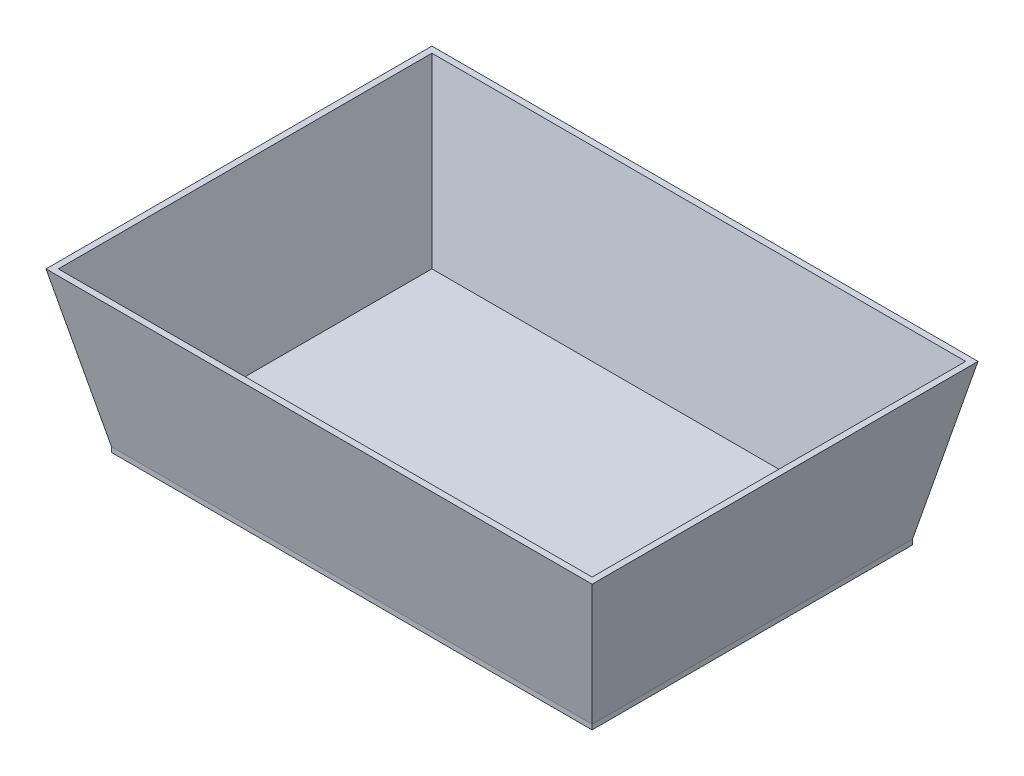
ISO-10303-21;
HEADER;
FILE_DESCRIPTION(('STEP AP214'),'2;1');
FILE_NAME('part.step','',(''),(''),'','','');
FILE_SCHEMA(('AUTOMOTIVE_DESIGN { 1 0 10303 214 1 1 1 1 }'));
ENDSEC;
DATA;
#1=APPLICATION_CONTEXT('core data for automotive mechanical design processes');
#2=APPLICATION_PROTOCOL_DEFINITION('international standard','automotive_design',2000,#1);
#3=PRODUCT_CONTEXT('',#1,'mechanical');
#4=PRODUCT('Part','Part','',(#3));
#5=PRODUCT_RELATED_PRODUCT_CATEGORY('part','',(#4));
#6=PRODUCT_DEFINITION_FORMATION('','',#4);
#7=PRODUCT_DEFINITION_CONTEXT('part definition',#1,'design');
#8=PRODUCT_DEFINITION('design','',#6,#7);
#9=PRODUCT_DEFINITION_SHAPE('','',#8);
#10=(LENGTH_UNIT() NAMED_UNIT(*) SI_UNIT(.MILLI.,.METRE.));
#11=(NAMED_UNIT(*) PLANE_ANGLE_UNIT() SI_UNIT($,.RADIAN.));
#12=(NAMED_UNIT(*) SI_UNIT($,.STERADIAN.) SOLID_ANGLE_UNIT());
#13=UNCERTAINTY_MEASURE_WITH_UNIT(LENGTH_MEASURE(1.E-05),#10,'distance_accuracy_value','');
#14=(GEOMETRIC_REPRESENTATION_CONTEXT(3) GLOBAL_UNCERTAINTY_ASSIGNED_CONTEXT((#13)) GLOBAL_UNIT_ASSIGNED_CONTEXT((#10,
#11,#12)) REPRESENTATION_CONTEXT('',''));
#15=CARTESIAN_POINT('',(0.,0.,0.));
#16=DIRECTION('',(0.,0.,1.));
#17=DIRECTION('',(1.,0.,0.));
#18=AXIS2_PLACEMENT_3D('',#15,#16,#17);
#19=CARTESIAN_POINT('',(123.825,0.,82.55));
#20=DIRECTION('',(0.978147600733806,-0.207911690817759,0.));
#21=DIRECTION('',(0.207911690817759,0.978147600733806,0.));
#22=AXIS2_PLACEMENT_3D('',#19,#20,#21);
#23=PLANE('',#22);
#24=DIRECTION('',(0.,0.,-1.));
#25=VECTOR('',#24,1.);
#26=CARTESIAN_POINT('',(123.825,0.,82.55));
#27=LINE('',#26,#25);
#28=CARTESIAN_POINT('',(123.825,0.,82.55));
#29=VERTEX_POINT('',#28);
#30=CARTESIAN_POINT('',(123.825,0.,-82.55));
#31=VERTEX_POINT('',#30);
#32=EDGE_CURVE('E178',#29,#31,#27,.T.);
#33=ORIENTED_EDGE('',*,*,#32,.T.);
#34=DIRECTION('',(-0.203558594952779,-0.957667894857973,0.203558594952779));
#35=VECTOR('',#34,1.);
#36=CARTESIAN_POINT('',(113.563349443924,-48.2772701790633,-72.2883494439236));
#37=LINE('',#36,#35);
#38=CARTESIAN_POINT('',(140.696677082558,79.375,-99.421677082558));
#39=VERTEX_POINT('',#38);
#40=EDGE_CURVE('E200',#39,#31,#37,.T.);
#41=ORIENTED_EDGE('',*,*,#40,.F.);
#42=DIRECTION('',(0.,0.,1.));
#43=VECTOR('',#42,1.);
#44=CARTESIAN_POINT('',(140.696677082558,79.375,0.));
#45=LINE('',#44,#43);
#46=CARTESIAN_POINT('',(140.696677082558,79.375,99.421677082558));
#47=VERTEX_POINT('',#46);
#48=EDGE_CURVE('E199',#47,#39,#45,.F.);
#49=ORIENTED_EDGE('',*,*,#48,.F.);
#50=DIRECTION('',(-0.203558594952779,-0.957667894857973,-0.203558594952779));
#51=VECTOR('',#50,1.);
#52=CARTESIAN_POINT('',(123.825,0.,82.55));
#53=LINE('',#52,#51);
#54=EDGE_CURVE('E206',#47,#29,#53,.T.);
#55=ORIENTED_EDGE('',*,*,#54,.T.);
#56=EDGE_LOOP('',(#33,#41,#49,#55));
#57=FACE_BOUND('',#56,.T.);
#58=ADVANCED_FACE('F47',(#57),#23,.T.);
#59=CARTESIAN_POINT('',(-123.825,0.,-82.55));
#60=DIRECTION('',(0.,-0.207911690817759,-0.978147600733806));
#61=DIRECTION('',(0.,0.978147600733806,-0.207911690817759));
#62=AXIS2_PLACEMENT_3D('',#59,#60,#61);
#63=PLANE('',#62);
#64=DIRECTION('',(-1.,0.,0.));
#65=VECTOR('',#64,1.);
#66=CARTESIAN_POINT('',(-123.825,0.,-82.55));
#67=LINE('',#66,#65);
#68=CARTESIAN_POINT('',(-123.825,0.,-82.55));
#69=VERTEX_POINT('',#68);
#70=EDGE_CURVE('E190',#31,#69,#67,.T.);
#71=ORIENTED_EDGE('',*,*,#70,.T.);
#72=DIRECTION('',(0.203558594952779,-0.957667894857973,0.203558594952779));
#73=VECTOR('',#72,1.);
#74=CARTESIAN_POINT('',(-116.983899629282,-32.1848467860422,-75.7088996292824));
#75=LINE('',#74,#73);
#76=CARTESIAN_POINT('',(-140.696677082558,79.375,-99.421677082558));
#77=VERTEX_POINT('',#76);
#78=EDGE_CURVE('E205',#77,#69,#75,.T.);
#79=ORIENTED_EDGE('',*,*,#78,.F.);
#80=DIRECTION('',(1.,0.,0.));
#81=VECTOR('',#80,1.);
#82=CARTESIAN_POINT('',(0.,79.375,-99.421677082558));
#83=LINE('',#82,#81);
#84=EDGE_CURVE('E219',#39,#77,#83,.F.);
#85=ORIENTED_EDGE('',*,*,#84,.F.);
#86=ORIENTED_EDGE('',*,*,#40,.T.);
#87=EDGE_LOOP('',(#71,#79,#85,#86));
#88=FACE_BOUND('',#87,.T.);
#89=ADVANCED_FACE('F49',(#88),#63,.T.);
#90=CARTESIAN_POINT('',(-123.825,0.,82.55));
#91=DIRECTION('',(-0.978147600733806,-0.207911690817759,0.));
#92=DIRECTION('',(0.207911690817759,-0.978147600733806,0.));
#93=AXIS2_PLACEMENT_3D('',#90,#91,#92);
#94=PLANE('',#93);
#95=DIRECTION('',(0.,0.,1.));
#96=VECTOR('',#95,1.);
#97=CARTESIAN_POINT('',(-123.825,0.,82.55));
#98=LINE('',#97,#96);
#99=CARTESIAN_POINT('',(-123.825,0.,82.55));
#100=VERTEX_POINT('',#99);
#101=EDGE_CURVE('E152',#69,#100,#98,.T.);
#102=ORIENTED_EDGE('',*,*,#101,.T.);
#103=DIRECTION('',(0.203558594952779,-0.957667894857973,-0.203558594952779));
#104=VECTOR('',#103,1.);
#105=CARTESIAN_POINT('',(-123.825,0.,82.55));
#106=LINE('',#105,#104);
#107=CARTESIAN_POINT('',(-140.696677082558,79.375,99.421677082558));
#108=VERTEX_POINT('',#107);
#109=EDGE_CURVE('E210',#108,#100,#106,.T.);
#110=ORIENTED_EDGE('',*,*,#109,.F.);
#111=DIRECTION('',(0.,0.,-1.));
#112=VECTOR('',#111,1.);
#113=CARTESIAN_POINT('',(-140.696677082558,79.375,0.));
#114=LINE('',#113,#112);
#115=EDGE_CURVE('E222',#77,#108,#114,.F.);
#116=ORIENTED_EDGE('',*,*,#115,.F.);
#117=ORIENTED_EDGE('',*,*,#78,.T.);
#118=EDGE_LOOP('',(#102,#110,#116,#117));
#119=FACE_BOUND('',#118,.T.);
#120=ADVANCED_FACE('F269',(#119),#94,.T.);
#121=CARTESIAN_POINT('',(-123.825,0.,82.55));
#122=DIRECTION('',(0.,-0.207911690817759,0.978147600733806));
#123=DIRECTION('',(0.,-0.978147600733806,-0.207911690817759));
#124=AXIS2_PLACEMENT_3D('',#121,#122,#123);
#125=PLANE('',#124);
#126=DIRECTION('',(1.,0.,0.));
#127=VECTOR('',#126,1.);
#128=CARTESIAN_POINT('',(-123.825,0.,82.55));
#129=LINE('',#128,#127);
#130=EDGE_CURVE('E195',#100,#29,#129,.T.);
#131=ORIENTED_EDGE('',*,*,#130,.T.);
#132=ORIENTED_EDGE('',*,*,#54,.F.);
#133=DIRECTION('',(-1.,0.,0.));
#134=VECTOR('',#133,1.);
#135=CARTESIAN_POINT('',(0.,79.375,99.421677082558));
#136=LINE('',#135,#134);
#137=EDGE_CURVE('E71',#108,#47,#136,.F.);
#138=ORIENTED_EDGE('',*,*,#137,.F.);
#139=ORIENTED_EDGE('',*,*,#109,.T.);
#140=EDGE_LOOP('',(#131,#132,#138,#139));
#141=FACE_BOUND('',#140,.T.);
#142=ADVANCED_FACE('F274',(#141),#125,.T.);
#143=CARTESIAN_POINT('',(0.,79.375,0.));
#144=DIRECTION('',(0.,-1.,0.));
#145=DIRECTION('',(0.,0.,-1.));
#146=AXIS2_PLACEMENT_3D('',#143,#144,#145);
#147=PLANE('',#146);
#148=DIRECTION('',(-1.,0.,0.));
#149=VECTOR('',#148,1.);
#150=CARTESIAN_POINT('',(-137.521677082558,79.375,-96.246677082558));
#151=LINE('',#150,#149);
#152=CARTESIAN_POINT('',(137.521677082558,79.375,-96.246677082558));
#153=VERTEX_POINT('',#152);
#154=CARTESIAN_POINT('',(-137.521677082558,79.375,-96.246677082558));
#155=VERTEX_POINT('',#154);
#156=EDGE_CURVE('E157',#153,#155,#151,.T.);
#157=ORIENTED_EDGE('',*,*,#156,.F.);
#158=DIRECTION('',(0.,0.,-1.));
#159=VECTOR('',#158,1.);
#160=CARTESIAN_POINT('',(137.521677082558,79.375,96.246677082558));
#161=LINE('',#160,#159);
#162=CARTESIAN_POINT('',(137.521677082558,79.375,96.246677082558));
#163=VERTEX_POINT('',#162);
#164=EDGE_CURVE('E63',#163,#153,#161,.T.);
#165=ORIENTED_EDGE('',*,*,#164,.F.);
#166=DIRECTION('',(1.,0.,0.));
#167=VECTOR('',#166,1.);
#168=CARTESIAN_POINT('',(-137.521677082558,79.375,96.246677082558));
#169=LINE('',#168,#167);
#170=CARTESIAN_POINT('',(-137.521677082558,79.375,96.246677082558));
#171=VERTEX_POINT('',#170);
#172=EDGE_CURVE('E170',#171,#163,#169,.T.);
#173=ORIENTED_EDGE('',*,*,#172,.F.);
#174=DIRECTION('',(0.,0.,1.));
#175=VECTOR('',#174,1.);
#176=CARTESIAN_POINT('',(-137.521677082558,79.375,96.246677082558));
#177=LINE('',#176,#175);
#178=EDGE_CURVE('E166',#155,#171,#177,.T.);
#179=ORIENTED_EDGE('',*,*,#178,.F.);
#180=EDGE_LOOP('',(#157,#165,#173,#179));
#181=FACE_BOUND('',#180,.T.);
#182=ORIENTED_EDGE('',*,*,#48,.T.);
#183=ORIENTED_EDGE('',*,*,#84,.T.);
#184=ORIENTED_EDGE('',*,*,#115,.T.);
#185=ORIENTED_EDGE('',*,*,#137,.T.);
#186=EDGE_LOOP('',(#182,#183,#184,#185));
#187=FACE_BOUND('',#186,.T.);
#188=ADVANCED_FACE('F247',(#181,#187),#147,.F.);
#189=CARTESIAN_POINT('',(137.521677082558,79.375,96.246677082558));
#190=DIRECTION('',(0.978147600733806,-0.207911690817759,0.));
#191=DIRECTION('',(0.207911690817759,0.978147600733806,0.));
#192=AXIS2_PLACEMENT_3D('',#189,#190,#191);
#193=PLANE('',#192);
#194=DIRECTION('',(0.,0.,1.));
#195=VECTOR('',#194,1.);
#196=CARTESIAN_POINT('',(120.65,0.,0.));
#197=LINE('',#196,#195);
#198=CARTESIAN_POINT('',(120.65,0.,-79.375));
#199=VERTEX_POINT('',#198);
#200=CARTESIAN_POINT('',(120.65,0.,79.375));
#201=VERTEX_POINT('',#200);
#202=EDGE_CURVE('E11',#199,#201,#197,.T.);
#203=ORIENTED_EDGE('',*,*,#202,.T.);
#204=DIRECTION('',(0.203558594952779,0.957667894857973,0.203558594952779));
#205=VECTOR('',#204,1.);
#206=CARTESIAN_POINT('',(126.124952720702,25.7576274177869,84.8499527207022));
#207=LINE('',#206,#205);
#208=EDGE_CURVE('E175',#201,#163,#207,.T.);
#209=ORIENTED_EDGE('',*,*,#208,.T.);
#210=ORIENTED_EDGE('',*,*,#164,.T.);
#211=DIRECTION('',(0.203558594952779,0.957667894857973,-0.203558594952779));
#212=VECTOR('',#211,1.);
#213=CARTESIAN_POINT('',(129.545502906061,41.850050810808,-88.270502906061));
#214=LINE('',#213,#212);
#215=EDGE_CURVE('E174',#199,#153,#214,.T.);
#216=ORIENTED_EDGE('',*,*,#215,.F.);
#217=EDGE_LOOP('',(#203,#209,#210,#216));
#218=FACE_BOUND('',#217,.T.);
#219=ADVANCED_FACE('F250',(#218),#193,.F.);
#220=CARTESIAN_POINT('',(-137.521677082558,79.375,96.246677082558));
#221=DIRECTION('',(0.,-0.207911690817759,0.978147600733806));
#222=DIRECTION('',(0.,-0.978147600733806,-0.207911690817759));
#223=AXIS2_PLACEMENT_3D('',#220,#221,#222);
#224=PLANE('',#223);
#225=DIRECTION('',(-1.,0.,0.));
#226=VECTOR('',#225,1.);
#227=CARTESIAN_POINT('',(0.,0.,79.375));
#228=LINE('',#227,#226);
#229=CARTESIAN_POINT('',(-120.65,0.,79.3749999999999));
#230=VERTEX_POINT('',#229);
#231=EDGE_CURVE('E56',#201,#230,#228,.T.);
#232=ORIENTED_EDGE('',*,*,#231,.T.);
#233=DIRECTION('',(-0.203558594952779,0.957667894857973,0.203558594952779));
#234=VECTOR('',#233,1.);
#235=CARTESIAN_POINT('',(-137.521677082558,79.375,96.246677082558));
#236=LINE('',#235,#234);
#237=EDGE_CURVE('E179',#230,#171,#236,.T.);
#238=ORIENTED_EDGE('',*,*,#237,.T.);
#239=ORIENTED_EDGE('',*,*,#172,.T.);
#240=ORIENTED_EDGE('',*,*,#208,.F.);
#241=EDGE_LOOP('',(#232,#238,#239,#240));
#242=FACE_BOUND('',#241,.T.);
#243=ADVANCED_FACE('F238',(#242),#224,.F.);
#244=CARTESIAN_POINT('',(-137.521677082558,79.375,96.246677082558));
#245=DIRECTION('',(-0.978147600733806,-0.207911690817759,0.));
#246=DIRECTION('',(0.207911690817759,-0.978147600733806,0.));
#247=AXIS2_PLACEMENT_3D('',#244,#245,#246);
#248=PLANE('',#247);
#249=DIRECTION('',(0.,0.,-1.));
#250=VECTOR('',#249,1.);
#251=CARTESIAN_POINT('',(-120.65,0.,0.));
#252=LINE('',#251,#250);
#253=CARTESIAN_POINT('',(-120.65,0.,-79.375));
#254=VERTEX_POINT('',#253);
#255=EDGE_CURVE('E230',#230,#254,#252,.T.);
#256=ORIENTED_EDGE('',*,*,#255,.T.);
#257=DIRECTION('',(-0.203558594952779,0.957667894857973,-0.203558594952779));
#258=VECTOR('',#257,1.);
#259=CARTESIAN_POINT('',(-137.521677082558,79.375,-96.246677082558));
#260=LINE('',#259,#258);
#261=EDGE_CURVE('E182',#254,#155,#260,.T.);
#262=ORIENTED_EDGE('',*,*,#261,.T.);
#263=ORIENTED_EDGE('',*,*,#178,.T.);
#264=ORIENTED_EDGE('',*,*,#237,.F.);
#265=EDGE_LOOP('',(#256,#262,#263,#264));
#266=FACE_BOUND('',#265,.T.);
#267=ADVANCED_FACE('F241',(#266),#248,.F.);
#268=CARTESIAN_POINT('',(-137.521677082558,79.375,-96.246677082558));
#269=DIRECTION('',(0.,-0.207911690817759,-0.978147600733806));
#270=DIRECTION('',(0.,0.978147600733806,-0.207911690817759));
#271=AXIS2_PLACEMENT_3D('',#268,#269,#270);
#272=PLANE('',#271);
#273=DIRECTION('',(1.,0.,0.));
#274=VECTOR('',#273,1.);
#275=CARTESIAN_POINT('',(0.,0.,-79.375));
#276=LINE('',#275,#274);
#277=EDGE_CURVE('E204',#254,#199,#276,.T.);
#278=ORIENTED_EDGE('',*,*,#277,.T.);
#279=ORIENTED_EDGE('',*,*,#215,.T.);
#280=ORIENTED_EDGE('',*,*,#156,.T.);
#281=ORIENTED_EDGE('',*,*,#261,.F.);
#282=EDGE_LOOP('',(#278,#279,#280,#281));
#283=FACE_BOUND('',#282,.T.);
#284=ADVANCED_FACE('F249',(#283),#272,.F.);
#285=CARTESIAN_POINT('',(0.,0.,0.));
#286=DIRECTION('',(0.,-1.,0.));
#287=DIRECTION('',(0.,0.,-1.));
#288=AXIS2_PLACEMENT_3D('',#285,#286,#287);
#289=PLANE('',#288);
#290=ORIENTED_EDGE('',*,*,#202,.F.);
#291=ORIENTED_EDGE('',*,*,#277,.F.);
#292=ORIENTED_EDGE('',*,*,#255,.F.);
#293=ORIENTED_EDGE('',*,*,#231,.F.);
#294=EDGE_LOOP('',(#290,#291,#292,#293));
#295=FACE_BOUND('',#294,.T.);
#296=ADVANCED_FACE('F251',(#295),#289,.F.);
#297=CARTESIAN_POINT('',(-123.825,-2.54,-82.55));
#298=DIRECTION('',(1.,0.,0.));
#299=DIRECTION('',(0.,0.,-1.));
#300=AXIS2_PLACEMENT_3D('',#297,#298,#299);
#301=PLANE('',#300);
#302=ORIENTED_EDGE('',*,*,#101,.F.);
#303=DIRECTION('',(0.,1.,0.));
#304=VECTOR('',#303,1.);
#305=CARTESIAN_POINT('',(-123.825,-2.54,-82.55));
#306=LINE('',#305,#304);
#307=CARTESIAN_POINT('',(-123.825,-2.54,-82.55));
#308=VERTEX_POINT('',#307);
#309=EDGE_CURVE('E131',#308,#69,#306,.T.);
#310=ORIENTED_EDGE('',*,*,#309,.F.);
#311=DIRECTION('',(0.,0.,-1.));
#312=VECTOR('',#311,1.);
#313=CARTESIAN_POINT('',(-123.825,-2.54,-82.55));
#314=LINE('',#313,#312);
#315=CARTESIAN_POINT('',(-123.825,-2.54,82.55));
#316=VERTEX_POINT('',#315);
#317=EDGE_CURVE('E139',#316,#308,#314,.T.);
#318=ORIENTED_EDGE('',*,*,#317,.F.);
#319=DIRECTION('',(0.,1.,0.));
#320=VECTOR('',#319,1.);
#321=CARTESIAN_POINT('',(-123.825,-2.54,82.55));
#322=LINE('',#321,#320);
#323=EDGE_CURVE('E293',#316,#100,#322,.T.);
#324=ORIENTED_EDGE('',*,*,#323,.T.);
#325=EDGE_LOOP('',(#302,#310,#318,#324));
#326=FACE_BOUND('',#325,.T.);
#327=ADVANCED_FACE('F150',(#326),#301,.F.);
#328=CARTESIAN_POINT('',(123.825,-2.54,-82.55));
#329=DIRECTION('',(0.,0.,1.));
#330=DIRECTION('',(1.,0.,0.));
#331=AXIS2_PLACEMENT_3D('',#328,#329,#330);
#332=PLANE('',#331);
#333=ORIENTED_EDGE('',*,*,#70,.F.);
#334=DIRECTION('',(0.,1.,0.));
#335=VECTOR('',#334,1.);
#336=CARTESIAN_POINT('',(123.825,-2.54,-82.55));
#337=LINE('',#336,#335);
#338=CARTESIAN_POINT('',(123.825,-2.54,-82.55));
#339=VERTEX_POINT('',#338);
#340=EDGE_CURVE('E134',#339,#31,#337,.T.);
#341=ORIENTED_EDGE('',*,*,#340,.F.);
#342=DIRECTION('',(1.,0.,0.));
#343=VECTOR('',#342,1.);
#344=CARTESIAN_POINT('',(123.825,-2.54,-82.55));
#345=LINE('',#344,#343);
#346=EDGE_CURVE('E127',#308,#339,#345,.T.);
#347=ORIENTED_EDGE('',*,*,#346,.F.);
#348=ORIENTED_EDGE('',*,*,#309,.T.);
#349=EDGE_LOOP('',(#333,#341,#347,#348));
#350=FACE_BOUND('',#349,.T.);
#351=ADVANCED_FACE('F129',(#350),#332,.F.);
#352=CARTESIAN_POINT('',(123.825,-2.54,-82.55));
#353=DIRECTION('',(-1.,0.,0.));
#354=DIRECTION('',(0.,0.,1.));
#355=AXIS2_PLACEMENT_3D('',#352,#353,#354);
#356=PLANE('',#355);
#357=ORIENTED_EDGE('',*,*,#32,.F.);
#358=DIRECTION('',(0.,1.,0.));
#359=VECTOR('',#358,1.);
#360=CARTESIAN_POINT('',(123.825,-2.54,82.55));
#361=LINE('',#360,#359);
#362=CARTESIAN_POINT('',(123.825,-2.54,82.55));
#363=VERTEX_POINT('',#362);
#364=EDGE_CURVE('E159',#363,#29,#361,.T.);
#365=ORIENTED_EDGE('',*,*,#364,.F.);
#366=DIRECTION('',(0.,0.,1.));
#367=VECTOR('',#366,1.);
#368=CARTESIAN_POINT('',(123.825,-2.54,-82.55));
#369=LINE('',#368,#367);
#370=EDGE_CURVE('E138',#339,#363,#369,.T.);
#371=ORIENTED_EDGE('',*,*,#370,.F.);
#372=ORIENTED_EDGE('',*,*,#340,.T.);
#373=EDGE_LOOP('',(#357,#365,#371,#372));
#374=FACE_BOUND('',#373,.T.);
#375=ADVANCED_FACE('F287',(#374),#356,.F.);
#376=CARTESIAN_POINT('',(123.825,-2.54,82.55));
#377=DIRECTION('',(0.,0.,-1.));
#378=DIRECTION('',(-1.,0.,0.));
#379=AXIS2_PLACEMENT_3D('',#376,#377,#378);
#380=PLANE('',#379);
#381=ORIENTED_EDGE('',*,*,#130,.F.);
#382=ORIENTED_EDGE('',*,*,#323,.F.);
#383=DIRECTION('',(-1.,0.,0.));
#384=VECTOR('',#383,1.);
#385=CARTESIAN_POINT('',(123.825,-2.54,82.55));
#386=LINE('',#385,#384);
#387=EDGE_CURVE('E144',#363,#316,#386,.T.);
#388=ORIENTED_EDGE('',*,*,#387,.F.);
#389=ORIENTED_EDGE('',*,*,#364,.T.);
#390=EDGE_LOOP('',(#381,#382,#388,#389));
#391=FACE_BOUND('',#390,.T.);
#392=ADVANCED_FACE('F299',(#391),#380,.F.);
#393=CARTESIAN_POINT('',(0.,-2.54,0.));
#394=DIRECTION('',(0.,-1.,0.));
#395=DIRECTION('',(0.,0.,-1.));
#396=AXIS2_PLACEMENT_3D('',#393,#394,#395);
#397=PLANE('',#396);
#398=ORIENTED_EDGE('',*,*,#317,.T.);
#399=ORIENTED_EDGE('',*,*,#346,.T.);
#400=ORIENTED_EDGE('',*,*,#370,.T.);
#401=ORIENTED_EDGE('',*,*,#387,.T.);
#402=EDGE_LOOP('',(#398,#399,#400,#401));
#403=FACE_BOUND('',#402,.T.);
#404=ADVANCED_FACE('F142',(#403),#397,.T.);
#405=CLOSED_SHELL('',(#58,#89,#120,#142,#188,#219,#243,#267,#284,#296,#327,#351,#375,#392,#404));
#406=MANIFOLD_SOLID_BREP('B2',#405);
#407=ADVANCED_BREP_SHAPE_REPRESENTATION('',(#18,#406),#14);
#408=SHAPE_DEFINITION_REPRESENTATION(#9,#407);
ENDSEC;
END-ISO-10303-21;
